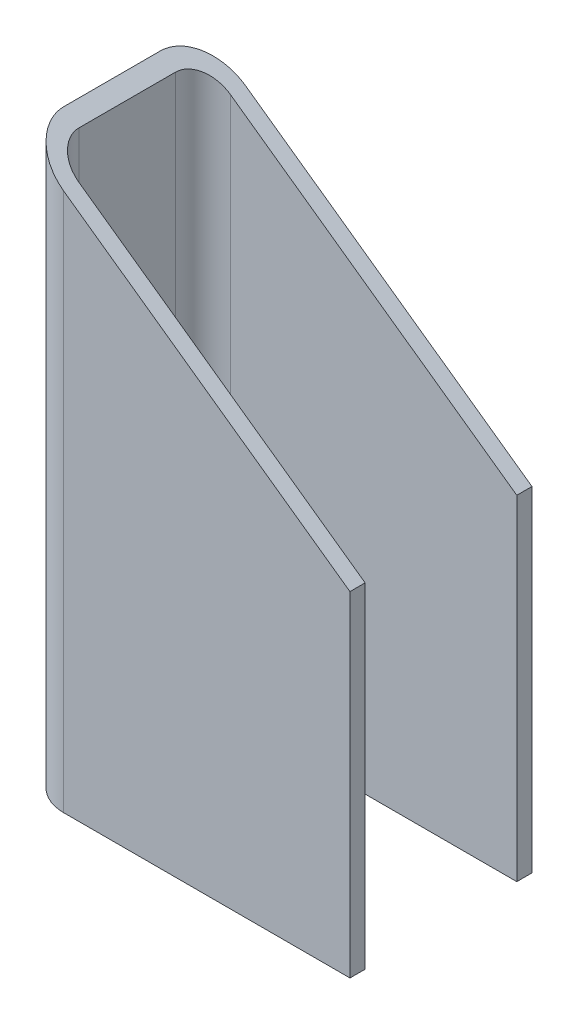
ISO-10303-21;
HEADER;
FILE_DESCRIPTION(('STEP AP214'),'2;1');
FILE_NAME('part.step','',(''),(''),'','','');
FILE_SCHEMA(('AUTOMOTIVE_DESIGN { 1 0 10303 214 1 1 1 1 }'));
ENDSEC;
DATA;
#1=APPLICATION_CONTEXT('core data for automotive mechanical design processes');
#2=APPLICATION_PROTOCOL_DEFINITION('international standard','automotive_design',2000,#1);
#3=PRODUCT_CONTEXT('',#1,'mechanical');
#4=PRODUCT('Part','Part','',(#3));
#5=PRODUCT_RELATED_PRODUCT_CATEGORY('part','',(#4));
#6=PRODUCT_DEFINITION_FORMATION('','',#4);
#7=PRODUCT_DEFINITION_CONTEXT('part definition',#1,'design');
#8=PRODUCT_DEFINITION('design','',#6,#7);
#9=PRODUCT_DEFINITION_SHAPE('','',#8);
#10=(LENGTH_UNIT() NAMED_UNIT(*) SI_UNIT(.MILLI.,.METRE.));
#11=(NAMED_UNIT(*) PLANE_ANGLE_UNIT() SI_UNIT($,.RADIAN.));
#12=(NAMED_UNIT(*) SI_UNIT($,.STERADIAN.) SOLID_ANGLE_UNIT());
#13=UNCERTAINTY_MEASURE_WITH_UNIT(LENGTH_MEASURE(1.E-05),#10,'distance_accuracy_value','');
#14=(GEOMETRIC_REPRESENTATION_CONTEXT(3) GLOBAL_UNCERTAINTY_ASSIGNED_CONTEXT((#13)) GLOBAL_UNIT_ASSIGNED_CONTEXT((#10,
#11,#12)) REPRESENTATION_CONTEXT('',''));
#15=CARTESIAN_POINT('',(0.,0.,0.));
#16=DIRECTION('',(0.,0.,1.));
#17=DIRECTION('',(1.,0.,0.));
#18=AXIS2_PLACEMENT_3D('',#15,#16,#17);
#19=CARTESIAN_POINT('',(-75.5,300.,25.5000000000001));
#20=DIRECTION('',(0.,-1.,0.));
#21=DIRECTION('',(0.,0.,-1.));
#22=AXIS2_PLACEMENT_3D('',#19,#20,#21);
#23=CYLINDRICAL_SURFACE('',#22,14.5);
#24=CARTESIAN_POINT('',(-75.5,283.986348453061,25.5000000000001));
#25=DIRECTION('',(-0.579852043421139,-0.814721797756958,0.));
#26=DIRECTION('',(0.814721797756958,-0.579852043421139,0.));
#27=AXIS2_PLACEMENT_3D('',#24,#25,#26);
#28=ELLIPSE('',#27,17.797486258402,14.5);
#29=CARTESIAN_POINT('',(-75.5,283.986348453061,40.0000000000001));
#30=VERTEX_POINT('',#29);
#31=CARTESIAN_POINT('',(-90.,294.306257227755,25.5000000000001));
#32=VERTEX_POINT('',#31);
#33=EDGE_CURVE('E281',#30,#32,#28,.T.);
#34=ORIENTED_EDGE('',*,*,#33,.F.);
#35=DIRECTION('',(0.,-1.,0.));
#36=VECTOR('',#35,1.);
#37=CARTESIAN_POINT('',(-75.5,300.,40.0000000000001));
#38=LINE('',#37,#36);
#39=CARTESIAN_POINT('',(-75.5,0.,40.0000000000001));
#40=VERTEX_POINT('',#39);
#41=EDGE_CURVE('E111',#30,#40,#38,.T.);
#42=ORIENTED_EDGE('',*,*,#41,.T.);
#43=CARTESIAN_POINT('',(-75.5,0.,25.5000000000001));
#44=DIRECTION('',(0.,1.,0.));
#45=DIRECTION('',(0.,0.,1.));
#46=AXIS2_PLACEMENT_3D('',#43,#44,#45);
#47=CIRCLE('',#46,14.5);
#48=CARTESIAN_POINT('',(-90.,0.,25.5000000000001));
#49=VERTEX_POINT('',#48);
#50=EDGE_CURVE('E127',#49,#40,#47,.T.);
#51=ORIENTED_EDGE('',*,*,#50,.F.);
#52=DIRECTION('',(0.,-1.,0.));
#53=VECTOR('',#52,1.);
#54=CARTESIAN_POINT('',(-90.,300.,25.5000000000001));
#55=LINE('',#54,#53);
#56=EDGE_CURVE('E11',#32,#49,#55,.T.);
#57=ORIENTED_EDGE('',*,*,#56,.F.);
#58=EDGE_LOOP('',(#34,#42,#51,#57));
#59=FACE_BOUND('',#58,.T.);
#60=ADVANCED_FACE('F41',(#59),#23,.F.);
#61=CARTESIAN_POINT('',(-90.,300.,0.));
#62=DIRECTION('',(1.,0.,0.));
#63=DIRECTION('',(0.,0.,-1.));
#64=AXIS2_PLACEMENT_3D('',#61,#62,#63);
#65=PLANE('',#64);
#66=DIRECTION('',(0.,0.,-1.));
#67=VECTOR('',#66,1.);
#68=CARTESIAN_POINT('',(-90.,294.306257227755,0.));
#69=LINE('',#68,#67);
#70=CARTESIAN_POINT('',(-90.,294.306257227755,-25.5000000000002));
#71=VERTEX_POINT('',#70);
#72=EDGE_CURVE('E276',#32,#71,#69,.T.);
#73=ORIENTED_EDGE('',*,*,#72,.F.);
#74=ORIENTED_EDGE('',*,*,#56,.T.);
#75=DIRECTION('',(0.,0.,1.));
#76=VECTOR('',#75,1.);
#77=CARTESIAN_POINT('',(-90.,0.,0.));
#78=LINE('',#77,#76);
#79=CARTESIAN_POINT('',(-90.,0.,-25.5000000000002));
#80=VERTEX_POINT('',#79);
#81=EDGE_CURVE('E176',#80,#49,#78,.T.);
#82=ORIENTED_EDGE('',*,*,#81,.F.);
#83=DIRECTION('',(0.,-1.,0.));
#84=VECTOR('',#83,1.);
#85=CARTESIAN_POINT('',(-90.,300.,-25.5000000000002));
#86=LINE('',#85,#84);
#87=EDGE_CURVE('E50',#71,#80,#86,.T.);
#88=ORIENTED_EDGE('',*,*,#87,.F.);
#89=EDGE_LOOP('',(#73,#74,#82,#88));
#90=FACE_BOUND('',#89,.T.);
#91=ADVANCED_FACE('F182',(#90),#65,.T.);
#92=CARTESIAN_POINT('',(-75.5,300.,-25.5000000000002));
#93=DIRECTION('',(0.,-1.,0.));
#94=DIRECTION('',(0.,0.,-1.));
#95=AXIS2_PLACEMENT_3D('',#92,#93,#94);
#96=CYLINDRICAL_SURFACE('',#95,14.5);
#97=DIRECTION('',(0.,-1.,0.));
#98=VECTOR('',#97,1.);
#99=CARTESIAN_POINT('',(-75.5,300.,-40.0000000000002));
#100=LINE('',#99,#98);
#101=CARTESIAN_POINT('',(-75.5,283.986348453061,-40.0000000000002));
#102=VERTEX_POINT('',#101);
#103=CARTESIAN_POINT('',(-75.5,0.,-40.0000000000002));
#104=VERTEX_POINT('',#103);
#105=EDGE_CURVE('E158',#102,#104,#100,.T.);
#106=ORIENTED_EDGE('',*,*,#105,.F.);
#107=CARTESIAN_POINT('',(-75.5,283.986348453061,-25.5000000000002));
#108=DIRECTION('',(-0.579852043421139,-0.814721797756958,0.));
#109=DIRECTION('',(0.814721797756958,-0.579852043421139,0.));
#110=AXIS2_PLACEMENT_3D('',#107,#108,#109);
#111=ELLIPSE('',#110,17.797486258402,14.5);
#112=EDGE_CURVE('E172',#102,#71,#111,.F.);
#113=ORIENTED_EDGE('',*,*,#112,.T.);
#114=ORIENTED_EDGE('',*,*,#87,.T.);
#115=CARTESIAN_POINT('',(-75.5,0.,-25.5000000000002));
#116=DIRECTION('',(0.,1.,0.));
#117=DIRECTION('',(0.,0.,1.));
#118=AXIS2_PLACEMENT_3D('',#115,#116,#117);
#119=CIRCLE('',#118,14.5);
#120=EDGE_CURVE('E168',#80,#104,#119,.F.);
#121=ORIENTED_EDGE('',*,*,#120,.T.);
#122=EDGE_LOOP('',(#106,#113,#114,#121));
#123=FACE_BOUND('',#122,.T.);
#124=ADVANCED_FACE('F167',(#123),#96,.F.);
#125=CARTESIAN_POINT('',(0.,300.,-40.0000000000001));
#126=DIRECTION('',(0.,0.,-1.));
#127=DIRECTION('',(-1.,0.,0.));
#128=AXIS2_PLACEMENT_3D('',#125,#126,#127);
#129=PLANE('',#128);
#130=DIRECTION('',(0.,-1.,0.));
#131=VECTOR('',#130,1.);
#132=CARTESIAN_POINT('',(75.5,300.,-40.0000000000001));
#133=LINE('',#132,#131);
#134=CARTESIAN_POINT('',(75.5,176.516953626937,-40.0000000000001));
#135=VERTEX_POINT('',#134);
#136=CARTESIAN_POINT('',(75.5,0.,-40.0000000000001));
#137=VERTEX_POINT('',#136);
#138=EDGE_CURVE('E155',#135,#137,#133,.T.);
#139=ORIENTED_EDGE('',*,*,#138,.F.);
#140=DIRECTION('',(-0.814721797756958,0.579852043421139,0.));
#141=VECTOR('',#140,1.);
#142=CARTESIAN_POINT('',(-32.9503824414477,253.703026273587,-40.0000000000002));
#143=LINE('',#142,#141);
#144=EDGE_CURVE('E270',#135,#102,#143,.T.);
#145=ORIENTED_EDGE('',*,*,#144,.T.);
#146=ORIENTED_EDGE('',*,*,#105,.T.);
#147=DIRECTION('',(1.,0.,0.));
#148=VECTOR('',#147,1.);
#149=CARTESIAN_POINT('',(0.,0.,-40.0000000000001));
#150=LINE('',#149,#148);
#151=EDGE_CURVE('E179',#104,#137,#150,.T.);
#152=ORIENTED_EDGE('',*,*,#151,.T.);
#153=EDGE_LOOP('',(#139,#145,#146,#152));
#154=FACE_BOUND('',#153,.T.);
#155=ADVANCED_FACE('F269',(#154),#129,.F.);
#156=CARTESIAN_POINT('',(75.5,300.,0.));
#157=DIRECTION('',(-1.,0.,0.));
#158=DIRECTION('',(0.,0.,1.));
#159=AXIS2_PLACEMENT_3D('',#156,#157,#158);
#160=PLANE('',#159);
#161=DIRECTION('',(0.,-1.,0.));
#162=VECTOR('',#161,1.);
#163=CARTESIAN_POINT('',(75.5,300.,-48.0000000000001));
#164=LINE('',#163,#162);
#165=CARTESIAN_POINT('',(75.5,176.516953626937,-48.0000000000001));
#166=VERTEX_POINT('',#165);
#167=CARTESIAN_POINT('',(75.5,0.,-48.0000000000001));
#168=VERTEX_POINT('',#167);
#169=EDGE_CURVE('E152',#166,#168,#164,.T.);
#170=ORIENTED_EDGE('',*,*,#169,.F.);
#171=DIRECTION('',(0.,0.,1.));
#172=VECTOR('',#171,1.);
#173=CARTESIAN_POINT('',(75.5,176.516953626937,-252.));
#174=LINE('',#173,#172);
#175=EDGE_CURVE('E253',#166,#135,#174,.T.);
#176=ORIENTED_EDGE('',*,*,#175,.T.);
#177=ORIENTED_EDGE('',*,*,#138,.T.);
#178=DIRECTION('',(0.,0.,-1.));
#179=VECTOR('',#178,1.);
#180=CARTESIAN_POINT('',(75.5,0.,0.));
#181=LINE('',#180,#179);
#182=EDGE_CURVE('E192',#137,#168,#181,.T.);
#183=ORIENTED_EDGE('',*,*,#182,.T.);
#184=EDGE_LOOP('',(#170,#176,#177,#183));
#185=FACE_BOUND('',#184,.T.);
#186=ADVANCED_FACE('F266',(#185),#160,.F.);
#187=CARTESIAN_POINT('',(0.,300.,-48.0000000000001));
#188=DIRECTION('',(0.,0.,-1.));
#189=DIRECTION('',(-1.,0.,0.));
#190=AXIS2_PLACEMENT_3D('',#187,#188,#189);
#191=PLANE('',#190);
#192=DIRECTION('',(-0.814721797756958,0.579852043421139,0.));
#193=VECTOR('',#192,1.);
#194=CARTESIAN_POINT('',(-32.9503824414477,253.703026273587,-48.0000000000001));
#195=LINE('',#194,#193);
#196=CARTESIAN_POINT('',(-75.5,283.986348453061,-48.0000000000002));
#197=VERTEX_POINT('',#196);
#198=EDGE_CURVE('E187',#166,#197,#195,.T.);
#199=ORIENTED_EDGE('',*,*,#198,.F.);
#200=ORIENTED_EDGE('',*,*,#169,.T.);
#201=DIRECTION('',(1.,0.,0.));
#202=VECTOR('',#201,1.);
#203=CARTESIAN_POINT('',(0.,0.,-48.0000000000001));
#204=LINE('',#203,#202);
#205=CARTESIAN_POINT('',(-75.5,0.,-48.0000000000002));
#206=VERTEX_POINT('',#205);
#207=EDGE_CURVE('E196',#206,#168,#204,.T.);
#208=ORIENTED_EDGE('',*,*,#207,.F.);
#209=DIRECTION('',(0.,-1.,0.));
#210=VECTOR('',#209,1.);
#211=CARTESIAN_POINT('',(-75.5,300.,-48.0000000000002));
#212=LINE('',#211,#210);
#213=EDGE_CURVE('E149',#197,#206,#212,.T.);
#214=ORIENTED_EDGE('',*,*,#213,.F.);
#215=EDGE_LOOP('',(#199,#200,#208,#214));
#216=FACE_BOUND('',#215,.T.);
#217=ADVANCED_FACE('F264',(#216),#191,.T.);
#218=CARTESIAN_POINT('',(-75.5,300.,-25.5000000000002));
#219=DIRECTION('',(0.,-1.,0.));
#220=DIRECTION('',(0.,0.,-1.));
#221=AXIS2_PLACEMENT_3D('',#218,#219,#220);
#222=CYLINDRICAL_SURFACE('',#221,22.5);
#223=CARTESIAN_POINT('',(-75.5,283.986348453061,-25.5000000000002));
#224=DIRECTION('',(-0.579852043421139,-0.814721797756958,0.));
#225=DIRECTION('',(0.814721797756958,-0.579852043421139,0.));
#226=AXIS2_PLACEMENT_3D('',#223,#224,#225);
#227=ELLIPSE('',#226,27.6167890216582,22.5);
#228=CARTESIAN_POINT('',(-98.,300.,-25.5000000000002));
#229=VERTEX_POINT('',#228);
#230=EDGE_CURVE('E57',#197,#229,#227,.F.);
#231=ORIENTED_EDGE('',*,*,#230,.F.);
#232=ORIENTED_EDGE('',*,*,#213,.T.);
#233=CARTESIAN_POINT('',(-75.5,0.,-25.5000000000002));
#234=DIRECTION('',(0.,1.,0.));
#235=DIRECTION('',(0.,0.,1.));
#236=AXIS2_PLACEMENT_3D('',#233,#234,#235);
#237=CIRCLE('',#236,22.5);
#238=CARTESIAN_POINT('',(-98.,0.,-25.5000000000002));
#239=VERTEX_POINT('',#238);
#240=EDGE_CURVE('E200',#239,#206,#237,.F.);
#241=ORIENTED_EDGE('',*,*,#240,.F.);
#242=DIRECTION('',(0.,-1.,0.));
#243=VECTOR('',#242,1.);
#244=CARTESIAN_POINT('',(-98.,300.,-25.5000000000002));
#245=LINE('',#244,#243);
#246=EDGE_CURVE('E146',#229,#239,#245,.T.);
#247=ORIENTED_EDGE('',*,*,#246,.F.);
#248=EDGE_LOOP('',(#231,#232,#241,#247));
#249=FACE_BOUND('',#248,.T.);
#250=ADVANCED_FACE('F260',(#249),#222,.T.);
#251=CARTESIAN_POINT('',(-98.,300.,0.));
#252=DIRECTION('',(1.,0.,0.));
#253=DIRECTION('',(0.,0.,-1.));
#254=AXIS2_PLACEMENT_3D('',#251,#252,#253);
#255=PLANE('',#254);
#256=DIRECTION('',(0.,0.,1.));
#257=VECTOR('',#256,1.);
#258=CARTESIAN_POINT('',(-98.,0.,0.));
#259=LINE('',#258,#257);
#260=CARTESIAN_POINT('',(-98.,0.,25.5000000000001));
#261=VERTEX_POINT('',#260);
#262=EDGE_CURVE('E204',#239,#261,#259,.T.);
#263=ORIENTED_EDGE('',*,*,#262,.T.);
#264=DIRECTION('',(0.,-1.,0.));
#265=VECTOR('',#264,1.);
#266=CARTESIAN_POINT('',(-98.,300.,25.5000000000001));
#267=LINE('',#266,#265);
#268=CARTESIAN_POINT('',(-98.,300.,25.5000000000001));
#269=VERTEX_POINT('',#268);
#270=EDGE_CURVE('E142',#269,#261,#267,.T.);
#271=ORIENTED_EDGE('',*,*,#270,.F.);
#272=DIRECTION('',(0.,0.,1.));
#273=VECTOR('',#272,1.);
#274=CARTESIAN_POINT('',(-98.,300.,0.));
#275=LINE('',#274,#273);
#276=EDGE_CURVE('E129',#229,#269,#275,.T.);
#277=ORIENTED_EDGE('',*,*,#276,.F.);
#278=ORIENTED_EDGE('',*,*,#246,.T.);
#279=EDGE_LOOP('',(#263,#271,#277,#278));
#280=FACE_BOUND('',#279,.T.);
#281=ADVANCED_FACE('F229',(#280),#255,.F.);
#282=CARTESIAN_POINT('',(-75.5,300.,25.5000000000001));
#283=DIRECTION('',(0.,-1.,0.));
#284=DIRECTION('',(0.,0.,-1.));
#285=AXIS2_PLACEMENT_3D('',#282,#283,#284);
#286=CYLINDRICAL_SURFACE('',#285,22.5);
#287=DIRECTION('',(0.,-1.,0.));
#288=VECTOR('',#287,1.);
#289=CARTESIAN_POINT('',(-75.5,300.,48.0000000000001));
#290=LINE('',#289,#288);
#291=CARTESIAN_POINT('',(-75.5,283.986348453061,48.));
#292=VERTEX_POINT('',#291);
#293=CARTESIAN_POINT('',(-75.5,0.,48.0000000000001));
#294=VERTEX_POINT('',#293);
#295=EDGE_CURVE('E139',#292,#294,#290,.T.);
#296=ORIENTED_EDGE('',*,*,#295,.F.);
#297=CARTESIAN_POINT('',(-75.5,283.986348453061,25.5000000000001));
#298=DIRECTION('',(-0.579852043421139,-0.814721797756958,0.));
#299=DIRECTION('',(0.814721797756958,-0.579852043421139,0.));
#300=AXIS2_PLACEMENT_3D('',#297,#298,#299);
#301=ELLIPSE('',#300,27.6167890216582,22.5);
#302=EDGE_CURVE('E226',#292,#269,#301,.T.);
#303=ORIENTED_EDGE('',*,*,#302,.T.);
#304=ORIENTED_EDGE('',*,*,#270,.T.);
#305=CARTESIAN_POINT('',(-75.5,0.,25.5000000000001));
#306=DIRECTION('',(0.,1.,0.));
#307=DIRECTION('',(0.,0.,1.));
#308=AXIS2_PLACEMENT_3D('',#305,#306,#307);
#309=CIRCLE('',#308,22.5);
#310=EDGE_CURVE('E207',#261,#294,#309,.T.);
#311=ORIENTED_EDGE('',*,*,#310,.T.);
#312=EDGE_LOOP('',(#296,#303,#304,#311));
#313=FACE_BOUND('',#312,.T.);
#314=ADVANCED_FACE('F220',(#313),#286,.T.);
#315=CARTESIAN_POINT('',(0.,300.,48.));
#316=DIRECTION('',(0.,0.,-1.));
#317=DIRECTION('',(-1.,0.,0.));
#318=AXIS2_PLACEMENT_3D('',#315,#316,#317);
#319=PLANE('',#318);
#320=DIRECTION('',(0.,-1.,0.));
#321=VECTOR('',#320,1.);
#322=CARTESIAN_POINT('',(75.5,300.,48.));
#323=LINE('',#322,#321);
#324=CARTESIAN_POINT('',(75.5,176.516953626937,48.));
#325=VERTEX_POINT('',#324);
#326=CARTESIAN_POINT('',(75.5,0.,48.));
#327=VERTEX_POINT('',#326);
#328=EDGE_CURVE('E110',#325,#327,#323,.T.);
#329=ORIENTED_EDGE('',*,*,#328,.F.);
#330=DIRECTION('',(0.814721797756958,-0.579852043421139,0.));
#331=VECTOR('',#330,1.);
#332=CARTESIAN_POINT('',(-98.,300.,48.));
#333=LINE('',#332,#331);
#334=EDGE_CURVE('E289',#292,#325,#333,.T.);
#335=ORIENTED_EDGE('',*,*,#334,.F.);
#336=ORIENTED_EDGE('',*,*,#295,.T.);
#337=DIRECTION('',(1.,0.,0.));
#338=VECTOR('',#337,1.);
#339=CARTESIAN_POINT('',(0.,0.,48.));
#340=LINE('',#339,#338);
#341=EDGE_CURVE('E121',#294,#327,#340,.T.);
#342=ORIENTED_EDGE('',*,*,#341,.T.);
#343=EDGE_LOOP('',(#329,#335,#336,#342));
#344=FACE_BOUND('',#343,.T.);
#345=ADVANCED_FACE('F212',(#344),#319,.F.);
#346=CARTESIAN_POINT('',(75.5,300.,0.));
#347=DIRECTION('',(-1.,0.,0.));
#348=DIRECTION('',(0.,0.,1.));
#349=AXIS2_PLACEMENT_3D('',#346,#347,#348);
#350=PLANE('',#349);
#351=DIRECTION('',(0.,-1.,0.));
#352=VECTOR('',#351,1.);
#353=CARTESIAN_POINT('',(75.5,300.,40.));
#354=LINE('',#353,#352);
#355=CARTESIAN_POINT('',(75.5,176.516953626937,40.));
#356=VERTEX_POINT('',#355);
#357=CARTESIAN_POINT('',(75.5,0.,40.));
#358=VERTEX_POINT('',#357);
#359=EDGE_CURVE('E98',#356,#358,#354,.T.);
#360=ORIENTED_EDGE('',*,*,#359,.F.);
#361=EDGE_CURVE('E286',#356,#325,#174,.T.);
#362=ORIENTED_EDGE('',*,*,#361,.T.);
#363=ORIENTED_EDGE('',*,*,#328,.T.);
#364=DIRECTION('',(0.,0.,-1.));
#365=VECTOR('',#364,1.);
#366=CARTESIAN_POINT('',(75.5,0.,0.));
#367=LINE('',#366,#365);
#368=EDGE_CURVE('E114',#327,#358,#367,.T.);
#369=ORIENTED_EDGE('',*,*,#368,.T.);
#370=EDGE_LOOP('',(#360,#362,#363,#369));
#371=FACE_BOUND('',#370,.T.);
#372=ADVANCED_FACE('F115',(#371),#350,.F.);
#373=CARTESIAN_POINT('',(0.,300.,40.));
#374=DIRECTION('',(0.,0.,-1.));
#375=DIRECTION('',(-1.,0.,0.));
#376=AXIS2_PLACEMENT_3D('',#373,#374,#375);
#377=PLANE('',#376);
#378=DIRECTION('',(-0.814721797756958,0.579852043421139,0.));
#379=VECTOR('',#378,1.);
#380=CARTESIAN_POINT('',(-32.9503824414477,253.703026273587,40.));
#381=LINE('',#380,#379);
#382=EDGE_CURVE('E106',#356,#30,#381,.T.);
#383=ORIENTED_EDGE('',*,*,#382,.F.);
#384=ORIENTED_EDGE('',*,*,#359,.T.);
#385=DIRECTION('',(1.,0.,0.));
#386=VECTOR('',#385,1.);
#387=CARTESIAN_POINT('',(0.,0.,40.));
#388=LINE('',#387,#386);
#389=EDGE_CURVE('E103',#40,#358,#388,.T.);
#390=ORIENTED_EDGE('',*,*,#389,.F.);
#391=ORIENTED_EDGE('',*,*,#41,.F.);
#392=EDGE_LOOP('',(#383,#384,#390,#391));
#393=FACE_BOUND('',#392,.T.);
#394=ADVANCED_FACE('F100',(#393),#377,.T.);
#395=CARTESIAN_POINT('',(0.,0.,0.));
#396=DIRECTION('',(0.,1.,0.));
#397=DIRECTION('',(0.,0.,1.));
#398=AXIS2_PLACEMENT_3D('',#395,#396,#397);
#399=PLANE('',#398);
#400=ORIENTED_EDGE('',*,*,#50,.T.);
#401=ORIENTED_EDGE('',*,*,#389,.T.);
#402=ORIENTED_EDGE('',*,*,#368,.F.);
#403=ORIENTED_EDGE('',*,*,#341,.F.);
#404=ORIENTED_EDGE('',*,*,#310,.F.);
#405=ORIENTED_EDGE('',*,*,#262,.F.);
#406=ORIENTED_EDGE('',*,*,#240,.T.);
#407=ORIENTED_EDGE('',*,*,#207,.T.);
#408=ORIENTED_EDGE('',*,*,#182,.F.);
#409=ORIENTED_EDGE('',*,*,#151,.F.);
#410=ORIENTED_EDGE('',*,*,#120,.F.);
#411=ORIENTED_EDGE('',*,*,#81,.T.);
#412=EDGE_LOOP('',(#400,#401,#402,#403,#404,#405,#406,#407,#408,#409,#410,#411));
#413=FACE_BOUND('',#412,.T.);
#414=ADVANCED_FACE('F124',(#413),#399,.F.);
#415=CARTESIAN_POINT('',(-98.,300.,-252.));
#416=DIRECTION('',(-0.579852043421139,-0.814721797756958,0.));
#417=DIRECTION('',(0.814721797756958,-0.579852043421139,0.));
#418=AXIS2_PLACEMENT_3D('',#415,#416,#417);
#419=PLANE('',#418);
#420=ORIENTED_EDGE('',*,*,#198,.T.);
#421=ORIENTED_EDGE('',*,*,#230,.T.);
#422=ORIENTED_EDGE('',*,*,#276,.T.);
#423=ORIENTED_EDGE('',*,*,#302,.F.);
#424=ORIENTED_EDGE('',*,*,#334,.T.);
#425=ORIENTED_EDGE('',*,*,#361,.F.);
#426=ORIENTED_EDGE('',*,*,#382,.T.);
#427=ORIENTED_EDGE('',*,*,#33,.T.);
#428=ORIENTED_EDGE('',*,*,#72,.T.);
#429=ORIENTED_EDGE('',*,*,#112,.F.);
#430=ORIENTED_EDGE('',*,*,#144,.F.);
#431=ORIENTED_EDGE('',*,*,#175,.F.);
#432=EDGE_LOOP('',(#420,#421,#422,#423,#424,#425,#426,#427,#428,#429,#430,#431));
#433=FACE_BOUND('',#432,.T.);
#434=ADVANCED_FACE('F251',(#433),#419,.F.);
#435=CLOSED_SHELL('',(#60,#91,#124,#155,#186,#217,#250,#281,#314,#345,#372,#394,#414,#434));
#436=MANIFOLD_SOLID_BREP('B2',#435);
#437=ADVANCED_BREP_SHAPE_REPRESENTATION('',(#18,#436),#14);
#438=SHAPE_DEFINITION_REPRESENTATION(#9,#437);
ENDSEC;
END-ISO-10303-21;
